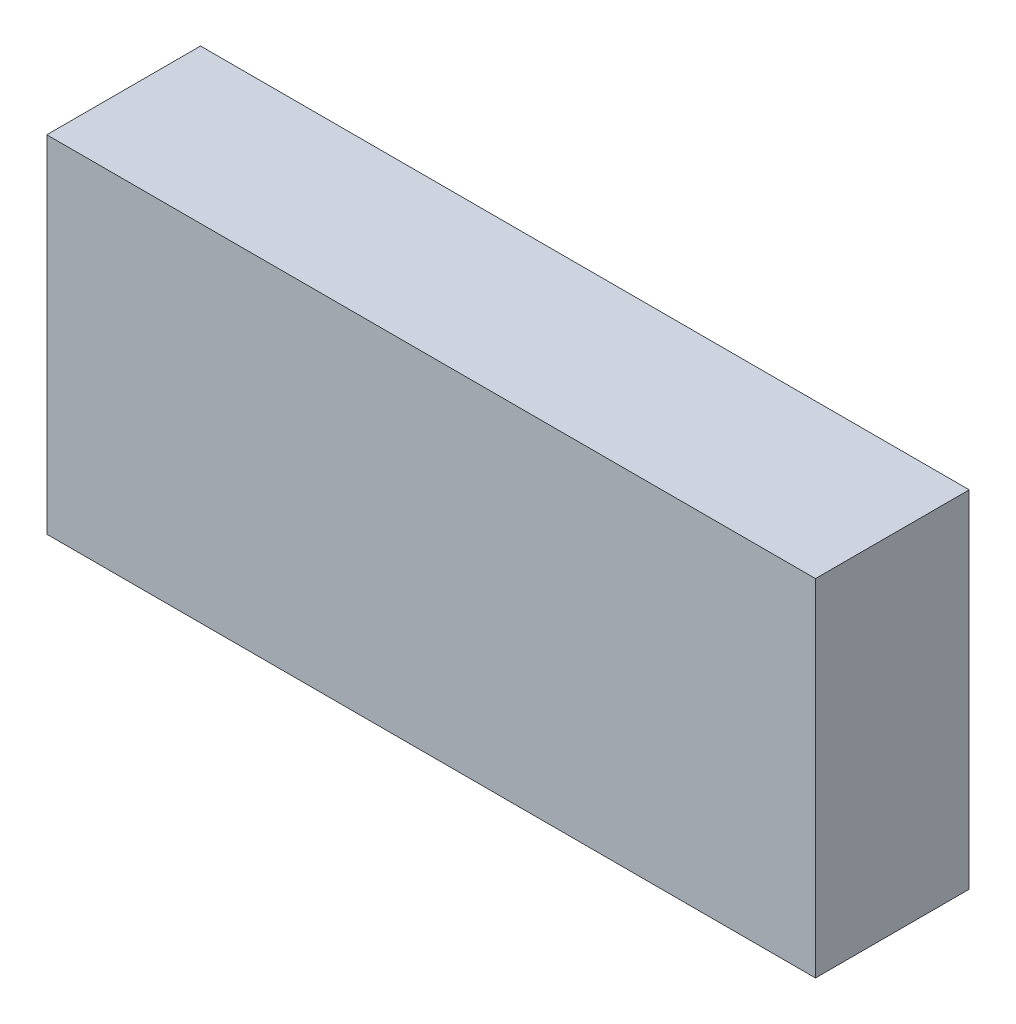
ISO-10303-21;
HEADER;
FILE_DESCRIPTION(('STEP AP214'),'2;1');
FILE_NAME('part.step','',(''),(''),'','','');
FILE_SCHEMA(('AUTOMOTIVE_DESIGN { 1 0 10303 214 1 1 1 1 }'));
ENDSEC;
DATA;
#1=APPLICATION_CONTEXT('core data for automotive mechanical design processes');
#2=APPLICATION_PROTOCOL_DEFINITION('international standard','automotive_design',2000,#1);
#3=PRODUCT_CONTEXT('',#1,'mechanical');
#4=PRODUCT('Part','Part','',(#3));
#5=PRODUCT_RELATED_PRODUCT_CATEGORY('part','',(#4));
#6=PRODUCT_DEFINITION_FORMATION('','',#4);
#7=PRODUCT_DEFINITION_CONTEXT('part definition',#1,'design');
#8=PRODUCT_DEFINITION('design','',#6,#7);
#9=PRODUCT_DEFINITION_SHAPE('','',#8);
#10=(LENGTH_UNIT() NAMED_UNIT(*) SI_UNIT(.MILLI.,.METRE.));
#11=(NAMED_UNIT(*) PLANE_ANGLE_UNIT() SI_UNIT($,.RADIAN.));
#12=(NAMED_UNIT(*) SI_UNIT($,.STERADIAN.) SOLID_ANGLE_UNIT());
#13=UNCERTAINTY_MEASURE_WITH_UNIT(LENGTH_MEASURE(1.E-05),#10,'distance_accuracy_value','');
#14=(GEOMETRIC_REPRESENTATION_CONTEXT(3) GLOBAL_UNCERTAINTY_ASSIGNED_CONTEXT((#13)) GLOBAL_UNIT_ASSIGNED_CONTEXT((#10,
#11,#12)) REPRESENTATION_CONTEXT('',''));
#15=CARTESIAN_POINT('',(0.,0.,0.));
#16=DIRECTION('',(0.,0.,1.));
#17=DIRECTION('',(1.,0.,0.));
#18=AXIS2_PLACEMENT_3D('',#15,#16,#17);
#19=CARTESIAN_POINT('',(0.,0.,8.));
#20=DIRECTION('',(1.,0.,0.));
#21=DIRECTION('',(0.,0.,-1.));
#22=AXIS2_PLACEMENT_3D('',#19,#20,#21);
#23=PLANE('',#22);
#24=DIRECTION('',(0.,-1.,0.));
#25=VECTOR('',#24,1.);
#26=CARTESIAN_POINT('',(0.,0.,0.));
#27=LINE('',#26,#25);
#28=CARTESIAN_POINT('',(0.,18.,0.));
#29=VERTEX_POINT('',#28);
#30=CARTESIAN_POINT('',(0.,0.,0.));
#31=VERTEX_POINT('',#30);
#32=EDGE_CURVE('E94',#29,#31,#27,.T.);
#33=ORIENTED_EDGE('',*,*,#32,.T.);
#34=DIRECTION('',(0.,0.,-1.));
#35=VECTOR('',#34,1.);
#36=CARTESIAN_POINT('',(0.,0.,8.));
#37=LINE('',#36,#35);
#38=CARTESIAN_POINT('',(0.,0.,8.));
#39=VERTEX_POINT('',#38);
#40=EDGE_CURVE('E11',#39,#31,#37,.T.);
#41=ORIENTED_EDGE('',*,*,#40,.F.);
#42=DIRECTION('',(0.,-1.,0.));
#43=VECTOR('',#42,1.);
#44=CARTESIAN_POINT('',(0.,0.,8.));
#45=LINE('',#44,#43);
#46=CARTESIAN_POINT('',(0.,18.,8.));
#47=VERTEX_POINT('',#46);
#48=EDGE_CURVE('E82',#47,#39,#45,.T.);
#49=ORIENTED_EDGE('',*,*,#48,.F.);
#50=DIRECTION('',(0.,0.,-1.));
#51=VECTOR('',#50,1.);
#52=CARTESIAN_POINT('',(0.,18.,8.));
#53=LINE('',#52,#51);
#54=EDGE_CURVE('E90',#47,#29,#53,.T.);
#55=ORIENTED_EDGE('',*,*,#54,.T.);
#56=EDGE_LOOP('',(#33,#41,#49,#55));
#57=FACE_BOUND('',#56,.T.);
#58=ADVANCED_FACE('F31',(#57),#23,.F.);
#59=CARTESIAN_POINT('',(0.,0.,8.));
#60=DIRECTION('',(0.,1.,0.));
#61=DIRECTION('',(0.,0.,1.));
#62=AXIS2_PLACEMENT_3D('',#59,#60,#61);
#63=PLANE('',#62);
#64=DIRECTION('',(1.,0.,0.));
#65=VECTOR('',#64,1.);
#66=CARTESIAN_POINT('',(0.,0.,0.));
#67=LINE('',#66,#65);
#68=CARTESIAN_POINT('',(40.,0.,0.));
#69=VERTEX_POINT('',#68);
#70=EDGE_CURVE('E86',#31,#69,#67,.T.);
#71=ORIENTED_EDGE('',*,*,#70,.T.);
#72=DIRECTION('',(0.,0.,-1.));
#73=VECTOR('',#72,1.);
#74=CARTESIAN_POINT('',(40.,0.,8.));
#75=LINE('',#74,#73);
#76=CARTESIAN_POINT('',(40.,0.,8.));
#77=VERTEX_POINT('',#76);
#78=EDGE_CURVE('E39',#77,#69,#75,.T.);
#79=ORIENTED_EDGE('',*,*,#78,.F.);
#80=DIRECTION('',(1.,0.,0.));
#81=VECTOR('',#80,1.);
#82=CARTESIAN_POINT('',(0.,0.,8.));
#83=LINE('',#82,#81);
#84=EDGE_CURVE('E77',#39,#77,#83,.T.);
#85=ORIENTED_EDGE('',*,*,#84,.F.);
#86=ORIENTED_EDGE('',*,*,#40,.T.);
#87=EDGE_LOOP('',(#71,#79,#85,#86));
#88=FACE_BOUND('',#87,.T.);
#89=ADVANCED_FACE('F85',(#88),#63,.F.);
#90=CARTESIAN_POINT('',(40.,0.,8.));
#91=DIRECTION('',(-1.,0.,0.));
#92=DIRECTION('',(0.,0.,1.));
#93=AXIS2_PLACEMENT_3D('',#90,#91,#92);
#94=PLANE('',#93);
#95=DIRECTION('',(0.,1.,0.));
#96=VECTOR('',#95,1.);
#97=CARTESIAN_POINT('',(40.,0.,0.));
#98=LINE('',#97,#96);
#99=CARTESIAN_POINT('',(40.,18.,0.));
#100=VERTEX_POINT('',#99);
#101=EDGE_CURVE('E64',#69,#100,#98,.T.);
#102=ORIENTED_EDGE('',*,*,#101,.T.);
#103=DIRECTION('',(0.,0.,-1.));
#104=VECTOR('',#103,1.);
#105=CARTESIAN_POINT('',(40.,18.,8.));
#106=LINE('',#105,#104);
#107=CARTESIAN_POINT('',(40.,18.,8.));
#108=VERTEX_POINT('',#107);
#109=EDGE_CURVE('E87',#108,#100,#106,.T.);
#110=ORIENTED_EDGE('',*,*,#109,.F.);
#111=DIRECTION('',(0.,1.,0.));
#112=VECTOR('',#111,1.);
#113=CARTESIAN_POINT('',(40.,0.,8.));
#114=LINE('',#113,#112);
#115=EDGE_CURVE('E80',#77,#108,#114,.T.);
#116=ORIENTED_EDGE('',*,*,#115,.F.);
#117=ORIENTED_EDGE('',*,*,#78,.T.);
#118=EDGE_LOOP('',(#102,#110,#116,#117));
#119=FACE_BOUND('',#118,.T.);
#120=ADVANCED_FACE('F88',(#119),#94,.F.);
#121=CARTESIAN_POINT('',(0.,18.,8.));
#122=DIRECTION('',(0.,-1.,0.));
#123=DIRECTION('',(0.,0.,-1.));
#124=AXIS2_PLACEMENT_3D('',#121,#122,#123);
#125=PLANE('',#124);
#126=DIRECTION('',(-1.,0.,0.));
#127=VECTOR('',#126,1.);
#128=CARTESIAN_POINT('',(0.,18.,0.));
#129=LINE('',#128,#127);
#130=EDGE_CURVE('E70',#100,#29,#129,.T.);
#131=ORIENTED_EDGE('',*,*,#130,.T.);
#132=ORIENTED_EDGE('',*,*,#54,.F.);
#133=DIRECTION('',(-1.,0.,0.));
#134=VECTOR('',#133,1.);
#135=CARTESIAN_POINT('',(0.,18.,8.));
#136=LINE('',#135,#134);
#137=EDGE_CURVE('E47',#108,#47,#136,.T.);
#138=ORIENTED_EDGE('',*,*,#137,.F.);
#139=ORIENTED_EDGE('',*,*,#109,.T.);
#140=EDGE_LOOP('',(#131,#132,#138,#139));
#141=FACE_BOUND('',#140,.T.);
#142=ADVANCED_FACE('F101',(#141),#125,.F.);
#143=CARTESIAN_POINT('',(0.,18.,8.));
#144=DIRECTION('',(0.,0.,-1.));
#145=DIRECTION('',(-1.,0.,0.));
#146=AXIS2_PLACEMENT_3D('',#143,#144,#145);
#147=PLANE('',#146);
#148=ORIENTED_EDGE('',*,*,#48,.T.);
#149=ORIENTED_EDGE('',*,*,#84,.T.);
#150=ORIENTED_EDGE('',*,*,#115,.T.);
#151=ORIENTED_EDGE('',*,*,#137,.T.);
#152=EDGE_LOOP('',(#148,#149,#150,#151));
#153=FACE_BOUND('',#152,.T.);
#154=ADVANCED_FACE('F78',(#153),#147,.F.);
#155=CARTESIAN_POINT('',(0.,18.,0.));
#156=DIRECTION('',(0.,0.,-1.));
#157=DIRECTION('',(-1.,0.,0.));
#158=AXIS2_PLACEMENT_3D('',#155,#156,#157);
#159=PLANE('',#158);
#160=ORIENTED_EDGE('',*,*,#32,.F.);
#161=ORIENTED_EDGE('',*,*,#130,.F.);
#162=ORIENTED_EDGE('',*,*,#101,.F.);
#163=ORIENTED_EDGE('',*,*,#70,.F.);
#164=EDGE_LOOP('',(#160,#161,#162,#163));
#165=FACE_BOUND('',#164,.T.);
#166=ADVANCED_FACE('F104',(#165),#159,.T.);
#167=CLOSED_SHELL('',(#58,#89,#120,#142,#154,#166));
#168=MANIFOLD_SOLID_BREP('B2',#167);
#169=ADVANCED_BREP_SHAPE_REPRESENTATION('',(#18,#168),#14);
#170=SHAPE_DEFINITION_REPRESENTATION(#9,#169);
ENDSEC;
END-ISO-10303-21;
